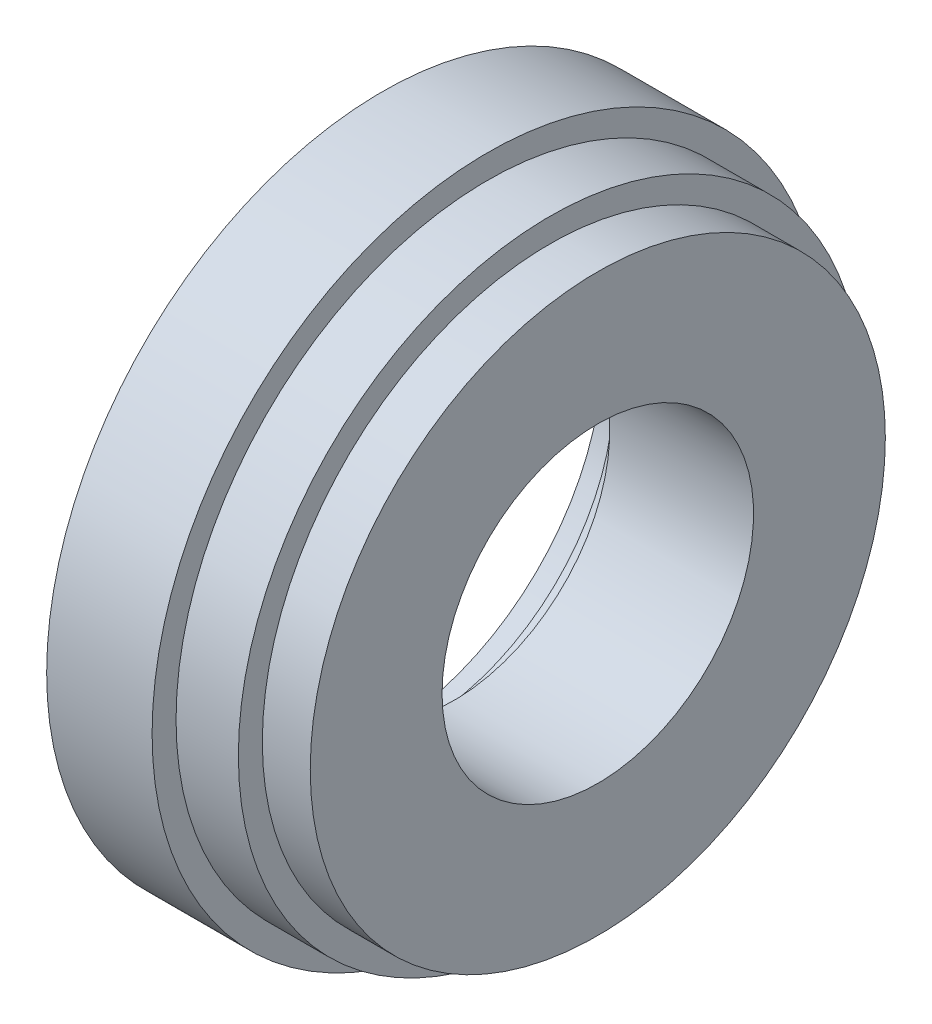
from build123d import *


with BuildPart() as part:
    # Esquisse1 → Base-R_volution (revolve)
    with BuildSketch(Plane.XY, mode=Mode.PRIVATE) as base_r_volution_sk:
        Polygon((0, 46), (0, 70), (22, 70), (22, 65), (35, 65), (35, 60), (45, 60), (45, 32.5), (15, 32.5), (15, 40), (8.31547619, 40), (8.31547619, 46), align=None)
    revolve(base_r_volution_sk.sketch.rotate(Axis((-4.434920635, 0, 0), (1, 0, 0)), 90), axis=Axis((-4.434920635, 0, 0), (1, 0, 0)))


solid = part.part
